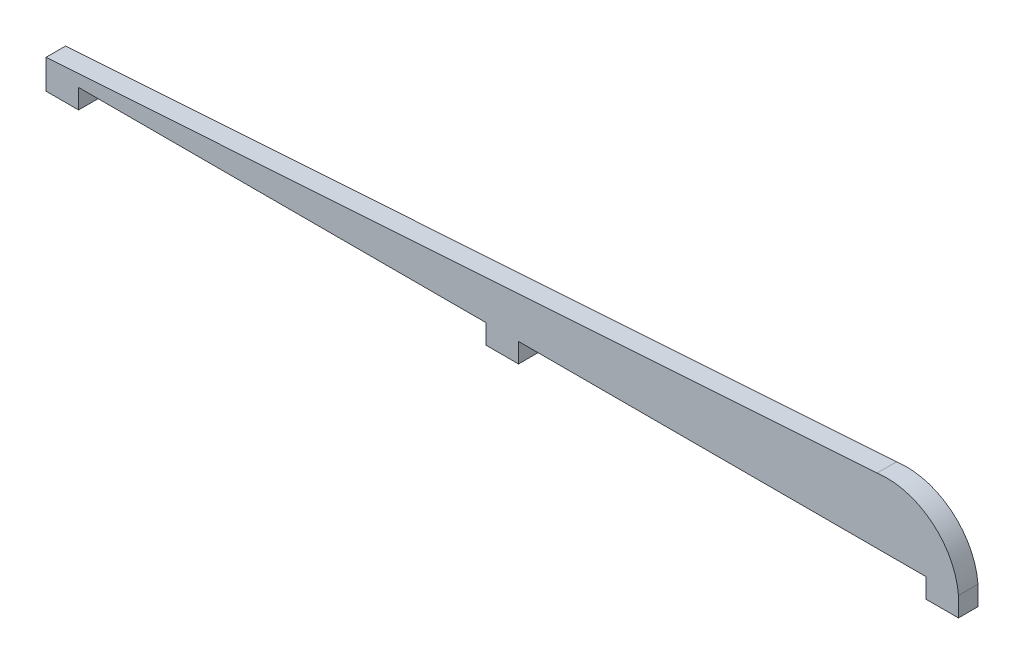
from build123d import *

# Parameters (mm, degrees)
BOSS_EXTRUDE1_DEPTH = 6


with BuildPart() as part:
    # Sketch1 → Boss-Extrude1 (new body)
    with BuildSketch(Plane.XY):
        with BuildLine():
            Line((140, 0), (140, -6))
            Line((140, -6), (130, -6))
            Line((130, -6), (130, 0))
            Line((130, 0), (5, 0))
            Line((5, 0), (5, -6))
            Line((5, -6), (-5, -6))
            Line((-5, -6), (-5, 0))
            Line((-5, 0), (-130, 0))
            Line((-130, 0), (-130, -6))
            Line((-130, -6), (-140, -6))
            Line((-140, -6), (-140, 0))
            Line((-140, 0), (-140, 3))
            Line((-140, 3), (115, 20))
            ThreePointArc((115, 20), (131.820366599, 15.400458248), (140, 0))
        make_face()
    extrude(amount=BOSS_EXTRUDE1_DEPTH)


solid = part.part
